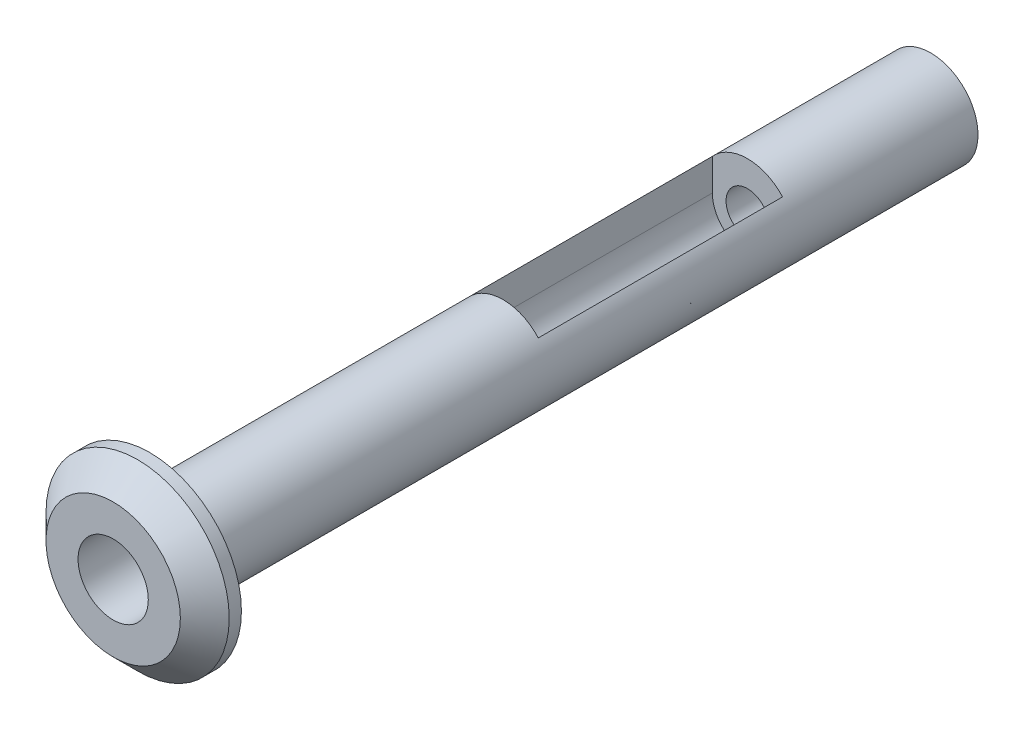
from build123d import *
from build123d.topology import SkipClean

# Parameters (mm, degrees)
CROQUIS1_R              = 7.5
CROQUIS1_R_2            = 1.75
SALIENTE_EXTRUIR1_DEPTH = 1.5
CHAFL_N1_SIZE           = 2
SALIENTE_EXTRUIR2_START = 63.93
CROQUIS2_R              = 3.875
CROQUIS2_R_2            = 1.75
SALIENTE_EXTRUIR2_DEPTH = 63.93
CROQUIS3_R              = 2.875
CORTAR_EXTRUIR1_DEPTH   = 51.93
CORTAR_EXTRUIR2_DEPTH   = 20


with BuildPart() as part:
    # Croquis1 → Saliente-Extruir1 (new, symmetric)
    with BuildSketch(Plane.XY):
        Circle(CROQUIS1_R)
        Circle(CROQUIS1_R_2, mode=Mode.SUBTRACT)
    extrude(amount=SALIENTE_EXTRUIR1_DEPTH, both=True)

    # Chafl_n1
    chafl_n1_edges = [part.edges().sort_by_distance(p)[0] for p in [
        (-7.5, 0, 1.5),
    ]]
    chamfer(chafl_n1_edges, length=CHAFL_N1_SIZE)

    # Croquis2 → Saliente-Extruir2 (add)
    with SkipClean():  # the faces are left unmerged after this step: merging them gives an invalid solid
        with BuildSketch(Plane(origin=(0, 0, -1.5), x_dir=(-1, 0, 0), z_dir=(0, 0, -1)).offset(SALIENTE_EXTRUIR2_START)):
            with Locations(Location((0, 0, 0), (0, 0, 180))):
                Circle(CROQUIS2_R)
            Circle(CROQUIS2_R_2, mode=Mode.SUBTRACT)
        extrude(amount=-SALIENTE_EXTRUIR2_DEPTH)

    # Croquis3 → Cortar-Extruir1 (cut)
    with BuildSketch(Plane.XY.offset(1.5)):
        Circle(CROQUIS3_R)
    extrude(amount=-CORTAR_EXTRUIR1_DEPTH, mode=Mode.SUBTRACT)

    # Croquis4 → Cortar-Extruir2 (cut)
    with BuildSketch(Plane.XY.offset(-50.43)):
        with BuildLine():
            Line((-2.875, 2.598076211), (-2.875, 0))
            Line((-2.875, 0), (2.875, 0))
            Line((2.875, 0), (2.875, 2.598076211))
            ThreePointArc((2.875, 2.598076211), (0, 3.875), (-2.875, 2.598076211))
        make_face()
    extrude(amount=CORTAR_EXTRUIR2_DEPTH, mode=Mode.SUBTRACT)


solid = part.part
